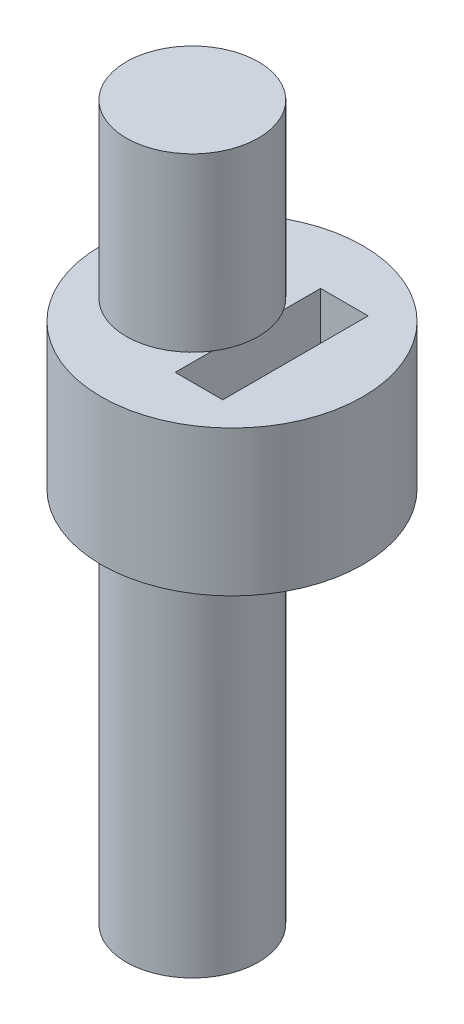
from build123d import *

# Parameters (mm, degrees)
SKETCH1_R           = 2.5
BOSS_EXTRUDE1_DEPTH = 15
SKETCH2_R           = 4.95
BOSS_EXTRUDE2_DEPTH = 5.5
SKETCH3_R           = 2.5
BOSS_EXTRUDE3_DEPTH = 6.5
SKETCH7_W           = 1.8
SKETCH7_H           = 5.5
CUT_EXTRUDE3_DEPTH  = 5.5


with BuildPart() as part:
    # Sketch1 → Boss-Extrude1 (new body)
    with BuildSketch(Plane(origin=(0, 0, 0), x_dir=(1, 0, 0), z_dir=(0, 1, 0))):
        with Locations(Location((0, 0, 0), (0, 0, 270))):
            Circle(SKETCH1_R)
    extrude(amount=BOSS_EXTRUDE1_DEPTH)

    # Sketch2 → Boss-Extrude2 (add)
    with BuildSketch(Plane(origin=(0, 15, 0), x_dir=(1, 0, 0), z_dir=(0, 1, 0))):
        with Locations(Location((1.5, 0, 0), (0, 0, 270))):
            Circle(SKETCH2_R)
    extrude(amount=BOSS_EXTRUDE2_DEPTH)

    # Sketch3 → Boss-Extrude3 (add)
    with BuildSketch(Plane(origin=(0, 20.5, 0), x_dir=(1, 0, 0), z_dir=(0, 1, 0))):
        with Locations(Location((0, 0, 0), (0, 0, 270))):
            Circle(SKETCH3_R)
    extrude(amount=BOSS_EXTRUDE3_DEPTH)

    # Sketch7 → Cut-Extrude3 (cut)
    with BuildSketch(Plane.XZ.offset(-15)):
        with Locations((3, 0)):
            Rectangle(SKETCH7_W, SKETCH7_H)
    extrude(amount=-CUT_EXTRUDE3_DEPTH, mode=Mode.SUBTRACT)


solid = part.part
